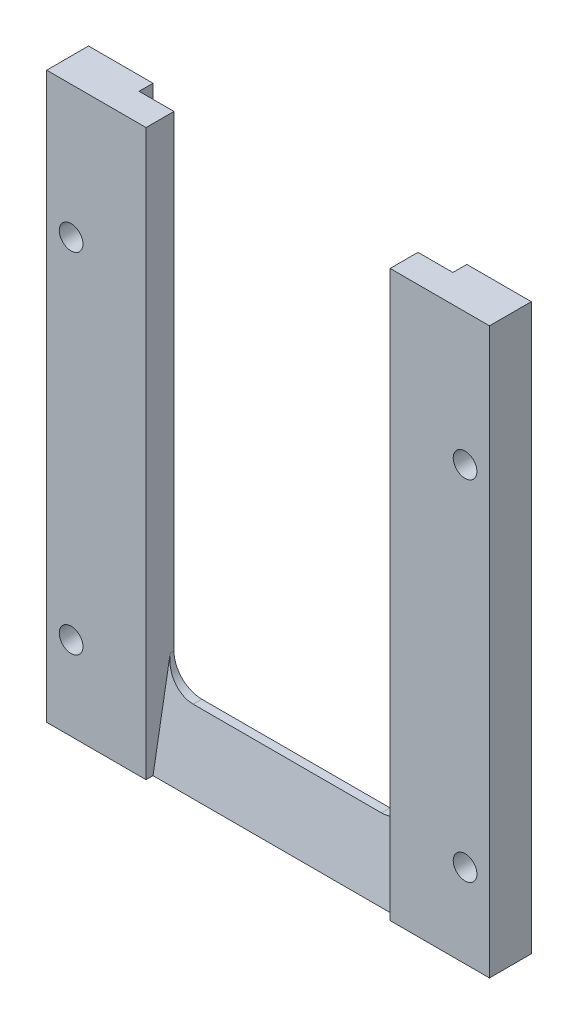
ISO-10303-21;
HEADER;
FILE_DESCRIPTION(('STEP AP214'),'2;1');
FILE_NAME('part.step','',(''),(''),'','','');
FILE_SCHEMA(('AUTOMOTIVE_DESIGN { 1 0 10303 214 1 1 1 1 }'));
ENDSEC;
DATA;
#1=APPLICATION_CONTEXT('core data for automotive mechanical design processes');
#2=APPLICATION_PROTOCOL_DEFINITION('international standard','automotive_design',2000,#1);
#3=PRODUCT_CONTEXT('',#1,'mechanical');
#4=PRODUCT('Part','Part','',(#3));
#5=PRODUCT_RELATED_PRODUCT_CATEGORY('part','',(#4));
#6=PRODUCT_DEFINITION_FORMATION('','',#4);
#7=PRODUCT_DEFINITION_CONTEXT('part definition',#1,'design');
#8=PRODUCT_DEFINITION('design','',#6,#7);
#9=PRODUCT_DEFINITION_SHAPE('','',#8);
#10=(LENGTH_UNIT() NAMED_UNIT(*) SI_UNIT(.MILLI.,.METRE.));
#11=(NAMED_UNIT(*) PLANE_ANGLE_UNIT() SI_UNIT($,.RADIAN.));
#12=(NAMED_UNIT(*) SI_UNIT($,.STERADIAN.) SOLID_ANGLE_UNIT());
#13=UNCERTAINTY_MEASURE_WITH_UNIT(LENGTH_MEASURE(1.E-05),#10,'distance_accuracy_value','');
#14=(GEOMETRIC_REPRESENTATION_CONTEXT(3) GLOBAL_UNCERTAINTY_ASSIGNED_CONTEXT((#13)) GLOBAL_UNIT_ASSIGNED_CONTEXT((#10,
#11,#12)) REPRESENTATION_CONTEXT('',''));
#15=CARTESIAN_POINT('',(0.,0.,0.));
#16=DIRECTION('',(0.,0.,1.));
#17=DIRECTION('',(1.,0.,0.));
#18=AXIS2_PLACEMENT_3D('',#15,#16,#17);
#19=CARTESIAN_POINT('',(31.75,0.,0.));
#20=DIRECTION('',(0.,0.,-1.));
#21=DIRECTION('',(-1.,0.,0.));
#22=AXIS2_PLACEMENT_3D('',#19,#20,#21);
#23=PLANE('',#22);
#24=CARTESIAN_POINT('',(28.25,22.,0.));
#25=DIRECTION('',(0.,0.,-1.));
#26=DIRECTION('',(0.,1.,0.));
#27=AXIS2_PLACEMENT_3D('',#24,#25,#26);
#28=CIRCLE('',#27,1.7);
#29=CARTESIAN_POINT('',(28.25,23.7,0.));
#30=VERTEX_POINT('',#29);
#31=EDGE_CURVE('E204',#30,#30,#28,.T.);
#32=ORIENTED_EDGE('',*,*,#31,.T.);
#33=EDGE_LOOP('',(#32));
#34=FACE_BOUND('',#33,.T.);
#35=CARTESIAN_POINT('',(28.25,-28.,0.));
#36=DIRECTION('',(0.,0.,-1.));
#37=DIRECTION('',(0.,1.,0.));
#38=AXIS2_PLACEMENT_3D('',#35,#36,#37);
#39=CIRCLE('',#38,1.7);
#40=CARTESIAN_POINT('',(28.25,-26.3,0.));
#41=VERTEX_POINT('',#40);
#42=EDGE_CURVE('E195',#41,#41,#39,.T.);
#43=ORIENTED_EDGE('',*,*,#42,.T.);
#44=EDGE_LOOP('',(#43));
#45=FACE_BOUND('',#44,.T.);
#46=DIRECTION('',(0.,-1.,0.));
#47=VECTOR('',#46,1.);
#48=CARTESIAN_POINT('',(17.5,-30.,0.));
#49=LINE('',#48,#47);
#50=CARTESIAN_POINT('',(17.5,41.,0.));
#51=VERTEX_POINT('',#50);
#52=CARTESIAN_POINT('',(17.5,-40.,0.));
#53=VERTEX_POINT('',#52);
#54=EDGE_CURVE('E271',#51,#53,#49,.T.);
#55=ORIENTED_EDGE('',*,*,#54,.T.);
#56=DIRECTION('',(-1.,0.,0.));
#57=VECTOR('',#56,1.);
#58=CARTESIAN_POINT('',(31.75,-40.,0.));
#59=LINE('',#58,#57);
#60=CARTESIAN_POINT('',(31.75,-40.,0.));
#61=VERTEX_POINT('',#60);
#62=EDGE_CURVE('E312',#61,#53,#59,.T.);
#63=ORIENTED_EDGE('',*,*,#62,.F.);
#64=DIRECTION('',(0.,-1.,0.));
#65=VECTOR('',#64,1.);
#66=CARTESIAN_POINT('',(31.75,-40.,0.));
#67=LINE('',#66,#65);
#68=CARTESIAN_POINT('',(31.75,41.,0.));
#69=VERTEX_POINT('',#68);
#70=EDGE_CURVE('E280',#69,#61,#67,.T.);
#71=ORIENTED_EDGE('',*,*,#70,.F.);
#72=DIRECTION('',(-1.,0.,0.));
#73=VECTOR('',#72,1.);
#74=CARTESIAN_POINT('',(31.75,41.,0.));
#75=LINE('',#74,#73);
#76=EDGE_CURVE('E301',#69,#51,#75,.T.);
#77=ORIENTED_EDGE('',*,*,#76,.T.);
#78=EDGE_LOOP('',(#55,#63,#71,#77));
#79=FACE_BOUND('',#78,.T.);
#80=ADVANCED_FACE('F32',(#34,#45,#79),#23,.F.);
#81=CARTESIAN_POINT('',(31.75,41.,0.));
#82=DIRECTION('',(0.,-1.,0.));
#83=DIRECTION('',(0.,0.,-1.));
#84=AXIS2_PLACEMENT_3D('',#81,#82,#83);
#85=PLANE('',#84);
#86=DIRECTION('',(1.,0.,0.));
#87=VECTOR('',#86,1.);
#88=CARTESIAN_POINT('',(22.5,41.,-4.));
#89=LINE('',#88,#87);
#90=CARTESIAN_POINT('',(-22.5,41.,-4.));
#91=VERTEX_POINT('',#90);
#92=CARTESIAN_POINT('',(-17.5,41.,-4.));
#93=VERTEX_POINT('',#92);
#94=EDGE_CURVE('E246',#91,#93,#89,.T.);
#95=ORIENTED_EDGE('',*,*,#94,.F.);
#96=DIRECTION('',(0.,0.,-1.));
#97=VECTOR('',#96,1.);
#98=CARTESIAN_POINT('',(-22.5,41.,-4.));
#99=LINE('',#98,#97);
#100=CARTESIAN_POINT('',(-22.5,41.,-6.));
#101=VERTEX_POINT('',#100);
#102=EDGE_CURVE('E255',#91,#101,#99,.T.);
#103=ORIENTED_EDGE('',*,*,#102,.T.);
#104=DIRECTION('',(-1.,0.,0.));
#105=VECTOR('',#104,1.);
#106=CARTESIAN_POINT('',(31.75,41.,-6.));
#107=LINE('',#106,#105);
#108=CARTESIAN_POINT('',(-31.75,41.,-6.));
#109=VERTEX_POINT('',#108);
#110=EDGE_CURVE('E304',#101,#109,#107,.T.);
#111=ORIENTED_EDGE('',*,*,#110,.T.);
#112=DIRECTION('',(0.,0.,1.));
#113=VECTOR('',#112,1.);
#114=CARTESIAN_POINT('',(-31.75,41.,0.));
#115=LINE('',#114,#113);
#116=CARTESIAN_POINT('',(-31.75,41.,0.));
#117=VERTEX_POINT('',#116);
#118=EDGE_CURVE('E296',#109,#117,#115,.T.);
#119=ORIENTED_EDGE('',*,*,#118,.T.);
#120=CARTESIAN_POINT('',(-17.5,41.,0.));
#121=VERTEX_POINT('',#120);
#122=EDGE_CURVE('E291',#121,#117,#75,.T.);
#123=ORIENTED_EDGE('',*,*,#122,.F.);
#124=DIRECTION('',(0.,0.,-1.));
#125=VECTOR('',#124,1.);
#126=CARTESIAN_POINT('',(-17.5,41.,0.));
#127=LINE('',#126,#125);
#128=EDGE_CURVE('E273',#121,#93,#127,.T.);
#129=ORIENTED_EDGE('',*,*,#128,.T.);
#130=EDGE_LOOP('',(#95,#103,#111,#119,#123,#129));
#131=FACE_BOUND('',#130,.T.);
#132=ADVANCED_FACE('F348',(#131),#85,.F.);
#133=CARTESIAN_POINT('',(31.75,-40.,-6.00000000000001));
#134=DIRECTION('',(0.,1.,0.));
#135=DIRECTION('',(0.,0.,1.));
#136=AXIS2_PLACEMENT_3D('',#133,#134,#135);
#137=PLANE('',#136);
#138=DIRECTION('',(1.,0.,0.));
#139=VECTOR('',#138,1.);
#140=CARTESIAN_POINT('',(-17.5,-40.,-1.));
#141=LINE('',#140,#139);
#142=CARTESIAN_POINT('',(-17.5,-40.,-1.));
#143=VERTEX_POINT('',#142);
#144=CARTESIAN_POINT('',(17.5,-40.,-1.));
#145=VERTEX_POINT('',#144);
#146=EDGE_CURVE('E160',#143,#145,#141,.T.);
#147=ORIENTED_EDGE('',*,*,#146,.F.);
#148=DIRECTION('',(0.,0.,-1.));
#149=VECTOR('',#148,1.);
#150=CARTESIAN_POINT('',(-17.5,-40.,-1.));
#151=LINE('',#150,#149);
#152=CARTESIAN_POINT('',(-17.5,-40.,0.));
#153=VERTEX_POINT('',#152);
#154=EDGE_CURVE('E166',#153,#143,#151,.T.);
#155=ORIENTED_EDGE('',*,*,#154,.F.);
#156=CARTESIAN_POINT('',(-31.75,-40.,0.));
#157=VERTEX_POINT('',#156);
#158=EDGE_CURVE('E311',#153,#157,#59,.T.);
#159=ORIENTED_EDGE('',*,*,#158,.T.);
#160=DIRECTION('',(0.,0.,-1.));
#161=VECTOR('',#160,1.);
#162=CARTESIAN_POINT('',(-31.75,-40.,-6.00000000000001));
#163=LINE('',#162,#161);
#164=CARTESIAN_POINT('',(-31.75,-40.,-6.00000000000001));
#165=VERTEX_POINT('',#164);
#166=EDGE_CURVE('E277',#157,#165,#163,.T.);
#167=ORIENTED_EDGE('',*,*,#166,.T.);
#168=DIRECTION('',(-1.,0.,0.));
#169=VECTOR('',#168,1.);
#170=CARTESIAN_POINT('',(31.75,-40.,-6.00000000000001));
#171=LINE('',#170,#169);
#172=CARTESIAN_POINT('',(31.75,-40.,-6.00000000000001));
#173=VERTEX_POINT('',#172);
#174=EDGE_CURVE('E308',#173,#165,#171,.T.);
#175=ORIENTED_EDGE('',*,*,#174,.F.);
#176=DIRECTION('',(0.,0.,-1.));
#177=VECTOR('',#176,1.);
#178=CARTESIAN_POINT('',(31.75,-40.,-6.00000000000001));
#179=LINE('',#178,#177);
#180=EDGE_CURVE('E283',#61,#173,#179,.T.);
#181=ORIENTED_EDGE('',*,*,#180,.F.);
#182=ORIENTED_EDGE('',*,*,#62,.T.);
#183=DIRECTION('',(0.,0.,-1.));
#184=VECTOR('',#183,1.);
#185=CARTESIAN_POINT('',(17.5,-40.,-1.));
#186=LINE('',#185,#184);
#187=EDGE_CURVE('E180',#53,#145,#186,.T.);
#188=ORIENTED_EDGE('',*,*,#187,.T.);
#189=EDGE_LOOP('',(#147,#155,#159,#167,#175,#181,#182,#188));
#190=FACE_BOUND('',#189,.T.);
#191=ADVANCED_FACE('F177',(#190),#137,.F.);
#192=CARTESIAN_POINT('',(31.75,41.,-6.));
#193=DIRECTION('',(0.,0.,1.));
#194=DIRECTION('',(0.,-1.,0.));
#195=AXIS2_PLACEMENT_3D('',#192,#193,#194);
#196=PLANE('',#195);
#197=CARTESIAN_POINT('',(28.25,-28.,-6.00000000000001));
#198=DIRECTION('',(0.,0.,-1.));
#199=DIRECTION('',(0.,1.,0.));
#200=AXIS2_PLACEMENT_3D('',#197,#198,#199);
#201=CIRCLE('',#200,3.15);
#202=CARTESIAN_POINT('',(28.25,-24.85,-6.00000000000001));
#203=VERTEX_POINT('',#202);
#204=EDGE_CURVE('E189',#203,#203,#201,.T.);
#205=ORIENTED_EDGE('',*,*,#204,.F.);
#206=EDGE_LOOP('',(#205));
#207=FACE_BOUND('',#206,.T.);
#208=CARTESIAN_POINT('',(28.25,22.,-6.));
#209=DIRECTION('',(0.,0.,-1.));
#210=DIRECTION('',(0.,1.,0.));
#211=AXIS2_PLACEMENT_3D('',#208,#209,#210);
#212=CIRCLE('',#211,3.15);
#213=CARTESIAN_POINT('',(28.25,25.15,-6.));
#214=VERTEX_POINT('',#213);
#215=EDGE_CURVE('E198',#214,#214,#212,.T.);
#216=ORIENTED_EDGE('',*,*,#215,.F.);
#217=EDGE_LOOP('',(#216));
#218=FACE_BOUND('',#217,.T.);
#219=CARTESIAN_POINT('',(-28.25,22.,-6.));
#220=DIRECTION('',(0.,0.,-1.));
#221=DIRECTION('',(0.,1.,0.));
#222=AXIS2_PLACEMENT_3D('',#219,#220,#221);
#223=CIRCLE('',#222,3.15);
#224=CARTESIAN_POINT('',(-28.25,25.15,-6.));
#225=VERTEX_POINT('',#224);
#226=EDGE_CURVE('E207',#225,#225,#223,.T.);
#227=ORIENTED_EDGE('',*,*,#226,.F.);
#228=EDGE_LOOP('',(#227));
#229=FACE_BOUND('',#228,.T.);
#230=CARTESIAN_POINT('',(-28.25,-28.,-6.00000000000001));
#231=DIRECTION('',(0.,0.,-1.));
#232=DIRECTION('',(0.,1.,0.));
#233=AXIS2_PLACEMENT_3D('',#230,#231,#232);
#234=CIRCLE('',#233,3.15);
#235=CARTESIAN_POINT('',(-28.25,-24.85,-6.00000000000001));
#236=VERTEX_POINT('',#235);
#237=EDGE_CURVE('E216',#236,#236,#234,.T.);
#238=ORIENTED_EDGE('',*,*,#237,.F.);
#239=EDGE_LOOP('',(#238));
#240=FACE_BOUND('',#239,.T.);
#241=DIRECTION('',(0.,1.,0.));
#242=VECTOR('',#241,1.);
#243=CARTESIAN_POINT('',(-22.5,-34.5,-6.00000000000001));
#244=LINE('',#243,#242);
#245=CARTESIAN_POINT('',(-22.5,-33.,-6.00000000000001));
#246=VERTEX_POINT('',#245);
#247=EDGE_CURVE('E241',#246,#101,#244,.T.);
#248=ORIENTED_EDGE('',*,*,#247,.F.);
#249=CARTESIAN_POINT('',(-22.5,-34.5,-6.00000000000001));
#250=DIRECTION('',(0.,0.,-1.));
#251=DIRECTION('',(0.,1.,0.));
#252=AXIS2_PLACEMENT_3D('',#249,#250,#251);
#253=CIRCLE('',#252,1.5);
#254=CARTESIAN_POINT('',(-21.,-34.5,-6.00000000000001));
#255=VERTEX_POINT('',#254);
#256=EDGE_CURVE('E225',#255,#246,#253,.T.);
#257=ORIENTED_EDGE('',*,*,#256,.F.);
#258=DIRECTION('',(-1.,0.,0.));
#259=VECTOR('',#258,1.);
#260=CARTESIAN_POINT('',(22.5,-34.5,-6.00000000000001));
#261=LINE('',#260,#259);
#262=CARTESIAN_POINT('',(21.,-34.5,-6.00000000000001));
#263=VERTEX_POINT('',#262);
#264=EDGE_CURVE('E245',#263,#255,#261,.T.);
#265=ORIENTED_EDGE('',*,*,#264,.F.);
#266=CARTESIAN_POINT('',(22.5,-34.5,-6.00000000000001));
#267=DIRECTION('',(0.,0.,-1.));
#268=DIRECTION('',(0.,1.,0.));
#269=AXIS2_PLACEMENT_3D('',#266,#267,#268);
#270=CIRCLE('',#269,1.5);
#271=CARTESIAN_POINT('',(22.5,-33.,-6.00000000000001));
#272=VERTEX_POINT('',#271);
#273=EDGE_CURVE('E233',#272,#263,#270,.T.);
#274=ORIENTED_EDGE('',*,*,#273,.F.);
#275=DIRECTION('',(0.,-1.,0.));
#276=VECTOR('',#275,1.);
#277=CARTESIAN_POINT('',(22.5,-34.5,-6.00000000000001));
#278=LINE('',#277,#276);
#279=CARTESIAN_POINT('',(22.5,41.,-6.));
#280=VERTEX_POINT('',#279);
#281=EDGE_CURVE('E257',#280,#272,#278,.T.);
#282=ORIENTED_EDGE('',*,*,#281,.F.);
#283=CARTESIAN_POINT('',(31.75,41.,-6.));
#284=VERTEX_POINT('',#283);
#285=EDGE_CURVE('E305',#284,#280,#107,.T.);
#286=ORIENTED_EDGE('',*,*,#285,.F.);
#287=DIRECTION('',(0.,1.,0.));
#288=VECTOR('',#287,1.);
#289=CARTESIAN_POINT('',(31.75,41.,-6.));
#290=LINE('',#289,#288);
#291=EDGE_CURVE('E286',#173,#284,#290,.T.);
#292=ORIENTED_EDGE('',*,*,#291,.F.);
#293=ORIENTED_EDGE('',*,*,#174,.T.);
#294=DIRECTION('',(0.,1.,0.));
#295=VECTOR('',#294,1.);
#296=CARTESIAN_POINT('',(-31.75,41.,-6.));
#297=LINE('',#296,#295);
#298=EDGE_CURVE('E293',#165,#109,#297,.T.);
#299=ORIENTED_EDGE('',*,*,#298,.T.);
#300=ORIENTED_EDGE('',*,*,#110,.F.);
#301=EDGE_LOOP('',(#248,#257,#265,#274,#282,#286,#292,#293,#299,#300));
#302=FACE_BOUND('',#301,.T.);
#303=ADVANCED_FACE('F360',(#207,#218,#229,#240,#302),#196,.F.);
#304=ORIENTED_EDGE('',*,*,#285,.T.);
#305=DIRECTION('',(0.,0.,-1.));
#306=VECTOR('',#305,1.);
#307=CARTESIAN_POINT('',(22.5,41.,-4.));
#308=LINE('',#307,#306);
#309=CARTESIAN_POINT('',(22.5,41.,-4.));
#310=VERTEX_POINT('',#309);
#311=EDGE_CURVE('E262',#310,#280,#308,.T.);
#312=ORIENTED_EDGE('',*,*,#311,.F.);
#313=CARTESIAN_POINT('',(17.5,41.,-4.));
#314=VERTEX_POINT('',#313);
#315=EDGE_CURVE('E244',#314,#310,#89,.T.);
#316=ORIENTED_EDGE('',*,*,#315,.F.);
#317=DIRECTION('',(0.,0.,-1.));
#318=VECTOR('',#317,1.);
#319=CARTESIAN_POINT('',(17.5,41.,0.));
#320=LINE('',#319,#318);
#321=EDGE_CURVE('E274',#51,#314,#320,.T.);
#322=ORIENTED_EDGE('',*,*,#321,.F.);
#323=ORIENTED_EDGE('',*,*,#76,.F.);
#324=DIRECTION('',(0.,0.,1.));
#325=VECTOR('',#324,1.);
#326=CARTESIAN_POINT('',(31.75,41.,0.));
#327=LINE('',#326,#325);
#328=EDGE_CURVE('E288',#284,#69,#327,.T.);
#329=ORIENTED_EDGE('',*,*,#328,.F.);
#330=EDGE_LOOP('',(#304,#312,#316,#322,#323,#329));
#331=FACE_BOUND('',#330,.T.);
#332=ADVANCED_FACE('F381',(#331),#85,.F.);
#333=CARTESIAN_POINT('',(-28.25,22.,0.));
#334=DIRECTION('',(0.,0.,-1.));
#335=DIRECTION('',(0.,1.,0.));
#336=AXIS2_PLACEMENT_3D('',#333,#334,#335);
#337=CIRCLE('',#336,1.7);
#338=CARTESIAN_POINT('',(-28.25,23.7,0.));
#339=VERTEX_POINT('',#338);
#340=EDGE_CURVE('E213',#339,#339,#337,.T.);
#341=ORIENTED_EDGE('',*,*,#340,.T.);
#342=EDGE_LOOP('',(#341));
#343=FACE_BOUND('',#342,.T.);
#344=CARTESIAN_POINT('',(-28.25,-28.,0.));
#345=DIRECTION('',(0.,0.,-1.));
#346=DIRECTION('',(0.,1.,0.));
#347=AXIS2_PLACEMENT_3D('',#344,#345,#346);
#348=CIRCLE('',#347,1.7);
#349=CARTESIAN_POINT('',(-28.25,-26.3,0.));
#350=VERTEX_POINT('',#349);
#351=EDGE_CURVE('E222',#350,#350,#348,.T.);
#352=ORIENTED_EDGE('',*,*,#351,.T.);
#353=EDGE_LOOP('',(#352));
#354=FACE_BOUND('',#353,.T.);
#355=ORIENTED_EDGE('',*,*,#158,.F.);
#356=DIRECTION('',(0.,1.,0.));
#357=VECTOR('',#356,1.);
#358=CARTESIAN_POINT('',(-17.5,-30.,0.));
#359=LINE('',#358,#357);
#360=EDGE_CURVE('E171',#153,#121,#359,.T.);
#361=ORIENTED_EDGE('',*,*,#360,.T.);
#362=ORIENTED_EDGE('',*,*,#122,.T.);
#363=DIRECTION('',(0.,-1.,0.));
#364=VECTOR('',#363,1.);
#365=CARTESIAN_POINT('',(-31.75,0.,0.));
#366=LINE('',#365,#364);
#367=EDGE_CURVE('E284',#117,#157,#366,.T.);
#368=ORIENTED_EDGE('',*,*,#367,.T.);
#369=EDGE_LOOP('',(#355,#361,#362,#368));
#370=FACE_BOUND('',#369,.T.);
#371=ADVANCED_FACE('F352',(#343,#354,#370),#23,.F.);
#372=CARTESIAN_POINT('',(31.75,0.,0.));
#373=DIRECTION('',(-1.,0.,0.));
#374=DIRECTION('',(0.,0.,1.));
#375=AXIS2_PLACEMENT_3D('',#372,#373,#374);
#376=PLANE('',#375);
#377=ORIENTED_EDGE('',*,*,#70,.T.);
#378=ORIENTED_EDGE('',*,*,#180,.T.);
#379=ORIENTED_EDGE('',*,*,#291,.T.);
#380=ORIENTED_EDGE('',*,*,#328,.T.);
#381=EDGE_LOOP('',(#377,#378,#379,#380));
#382=FACE_BOUND('',#381,.T.);
#383=ADVANCED_FACE('F365',(#382),#376,.F.);
#384=CARTESIAN_POINT('',(-31.75,0.,0.));
#385=DIRECTION('',(-1.,0.,0.));
#386=DIRECTION('',(0.,0.,1.));
#387=AXIS2_PLACEMENT_3D('',#384,#385,#386);
#388=PLANE('',#387);
#389=ORIENTED_EDGE('',*,*,#166,.F.);
#390=ORIENTED_EDGE('',*,*,#367,.F.);
#391=ORIENTED_EDGE('',*,*,#118,.F.);
#392=ORIENTED_EDGE('',*,*,#298,.F.);
#393=EDGE_LOOP('',(#389,#390,#391,#392));
#394=FACE_BOUND('',#393,.T.);
#395=ADVANCED_FACE('F363',(#394),#388,.T.);
#396=CARTESIAN_POINT('',(-17.5,-30.,0.));
#397=DIRECTION('',(-1.,0.,0.));
#398=DIRECTION('',(0.,0.,1.));
#399=AXIS2_PLACEMENT_3D('',#396,#397,#398);
#400=PLANE('',#399);
#401=ORIENTED_EDGE('',*,*,#128,.F.);
#402=ORIENTED_EDGE('',*,*,#360,.F.);
#403=ORIENTED_EDGE('',*,*,#154,.T.);
#404=DIRECTION('',(0.,0.984807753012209,-0.173648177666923));
#405=VECTOR('',#404,1.);
#406=CARTESIAN_POINT('',(-17.5,-25.,-3.64490471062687));
#407=LINE('',#406,#405);
#408=CARTESIAN_POINT('',(-17.5,-26.,-3.46857772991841));
#409=VERTEX_POINT('',#408);
#410=EDGE_CURVE('E156',#143,#409,#407,.T.);
#411=ORIENTED_EDGE('',*,*,#410,.T.);
#412=DIRECTION('',(0.,0.,-1.));
#413=VECTOR('',#412,1.);
#414=CARTESIAN_POINT('',(-17.5,-26.,-4.00000000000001));
#415=LINE('',#414,#413);
#416=CARTESIAN_POINT('',(-17.5,-26.,-4.00000000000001));
#417=VERTEX_POINT('',#416);
#418=EDGE_CURVE('E322',#409,#417,#415,.T.);
#419=ORIENTED_EDGE('',*,*,#418,.T.);
#420=DIRECTION('',(0.,1.,0.));
#421=VECTOR('',#420,1.);
#422=CARTESIAN_POINT('',(-17.5,-30.,-4.00000000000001));
#423=LINE('',#422,#421);
#424=EDGE_CURVE('E268',#417,#93,#423,.T.);
#425=ORIENTED_EDGE('',*,*,#424,.T.);
#426=EDGE_LOOP('',(#401,#402,#403,#411,#419,#425));
#427=FACE_BOUND('',#426,.T.);
#428=ADVANCED_FACE('F170',(#427),#400,.F.);
#429=CARTESIAN_POINT('',(17.5,-30.,0.));
#430=DIRECTION('',(0.,-1.,0.));
#431=DIRECTION('',(0.,0.,-1.));
#432=AXIS2_PLACEMENT_3D('',#429,#430,#431);
#433=PLANE('',#432);
#434=DIRECTION('',(0.,0.,-1.));
#435=VECTOR('',#434,1.);
#436=CARTESIAN_POINT('',(-13.5,-30.,0.));
#437=LINE('',#436,#435);
#438=CARTESIAN_POINT('',(-13.5,-30.,-4.00000000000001));
#439=VERTEX_POINT('',#438);
#440=CARTESIAN_POINT('',(-13.5,-30.,-2.76326980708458));
#441=VERTEX_POINT('',#440);
#442=EDGE_CURVE('E326',#439,#441,#437,.F.);
#443=ORIENTED_EDGE('',*,*,#442,.T.);
#444=DIRECTION('',(1.,0.,0.));
#445=VECTOR('',#444,1.);
#446=CARTESIAN_POINT('',(17.5,-30.,-2.76326980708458));
#447=LINE('',#446,#445);
#448=CARTESIAN_POINT('',(13.5,-30.,-2.76326980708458));
#449=VERTEX_POINT('',#448);
#450=EDGE_CURVE('E181',#441,#449,#447,.T.);
#451=ORIENTED_EDGE('',*,*,#450,.T.);
#452=DIRECTION('',(0.,0.,-1.));
#453=VECTOR('',#452,1.);
#454=CARTESIAN_POINT('',(13.5,-30.,-4.));
#455=LINE('',#454,#453);
#456=CARTESIAN_POINT('',(13.5,-30.,-4.00000000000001));
#457=VERTEX_POINT('',#456);
#458=EDGE_CURVE('E324',#449,#457,#455,.T.);
#459=ORIENTED_EDGE('',*,*,#458,.T.);
#460=DIRECTION('',(-1.,0.,0.));
#461=VECTOR('',#460,1.);
#462=CARTESIAN_POINT('',(17.5,-30.,-4.00000000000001));
#463=LINE('',#462,#461);
#464=EDGE_CURVE('E264',#457,#439,#463,.T.);
#465=ORIENTED_EDGE('',*,*,#464,.T.);
#466=EDGE_LOOP('',(#443,#451,#459,#465));
#467=FACE_BOUND('',#466,.T.);
#468=ADVANCED_FACE('F338',(#467),#433,.F.);
#469=CARTESIAN_POINT('',(17.5,-30.,0.));
#470=DIRECTION('',(1.,0.,0.));
#471=DIRECTION('',(0.,0.,-1.));
#472=AXIS2_PLACEMENT_3D('',#469,#470,#471);
#473=PLANE('',#472);
#474=ORIENTED_EDGE('',*,*,#187,.F.);
#475=ORIENTED_EDGE('',*,*,#54,.F.);
#476=ORIENTED_EDGE('',*,*,#321,.T.);
#477=DIRECTION('',(0.,-1.,0.));
#478=VECTOR('',#477,1.);
#479=CARTESIAN_POINT('',(17.5,-30.,-4.00000000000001));
#480=LINE('',#479,#478);
#481=CARTESIAN_POINT('',(17.5,-26.,-4.00000000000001));
#482=VERTEX_POINT('',#481);
#483=EDGE_CURVE('E314',#314,#482,#480,.T.);
#484=ORIENTED_EDGE('',*,*,#483,.T.);
#485=DIRECTION('',(0.,0.,-1.));
#486=VECTOR('',#485,1.);
#487=CARTESIAN_POINT('',(17.5,-26.,0.));
#488=LINE('',#487,#486);
#489=CARTESIAN_POINT('',(17.5,-26.,-3.46857772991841));
#490=VERTEX_POINT('',#489);
#491=EDGE_CURVE('E329',#482,#490,#488,.F.);
#492=ORIENTED_EDGE('',*,*,#491,.T.);
#493=DIRECTION('',(0.,0.984807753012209,-0.173648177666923));
#494=VECTOR('',#493,1.);
#495=CARTESIAN_POINT('',(17.5,-25.,-3.64490471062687));
#496=LINE('',#495,#494);
#497=EDGE_CURVE('E174',#145,#490,#496,.T.);
#498=ORIENTED_EDGE('',*,*,#497,.F.);
#499=EDGE_LOOP('',(#474,#475,#476,#484,#492,#498));
#500=FACE_BOUND('',#499,.T.);
#501=ADVANCED_FACE('F334',(#500),#473,.F.);
#502=CARTESIAN_POINT('',(0.,0.,-4.00000000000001));
#503=DIRECTION('',(0.,0.,1.));
#504=DIRECTION('',(0.,-1.,0.));
#505=AXIS2_PLACEMENT_3D('',#502,#503,#504);
#506=PLANE('',#505);
#507=DIRECTION('',(-1.,0.,0.));
#508=VECTOR('',#507,1.);
#509=CARTESIAN_POINT('',(22.5,-34.5,-4.00000000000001));
#510=LINE('',#509,#508);
#511=CARTESIAN_POINT('',(21.,-34.5,-4.00000000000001));
#512=VERTEX_POINT('',#511);
#513=CARTESIAN_POINT('',(-21.,-34.5,-4.00000000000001));
#514=VERTEX_POINT('',#513);
#515=EDGE_CURVE('E252',#512,#514,#510,.T.);
#516=ORIENTED_EDGE('',*,*,#515,.T.);
#517=CARTESIAN_POINT('',(-22.5,-34.5,-4.00000000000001));
#518=DIRECTION('',(0.,0.,-1.));
#519=DIRECTION('',(0.,1.,0.));
#520=AXIS2_PLACEMENT_3D('',#517,#518,#519);
#521=CIRCLE('',#520,1.5);
#522=CARTESIAN_POINT('',(-22.5,-33.,-4.00000000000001));
#523=VERTEX_POINT('',#522);
#524=EDGE_CURVE('E226',#514,#523,#521,.T.);
#525=ORIENTED_EDGE('',*,*,#524,.T.);
#526=DIRECTION('',(0.,1.,0.));
#527=VECTOR('',#526,1.);
#528=CARTESIAN_POINT('',(-22.5,-34.5,-4.00000000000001));
#529=LINE('',#528,#527);
#530=EDGE_CURVE('E242',#523,#91,#529,.T.);
#531=ORIENTED_EDGE('',*,*,#530,.T.);
#532=ORIENTED_EDGE('',*,*,#94,.T.);
#533=ORIENTED_EDGE('',*,*,#424,.F.);
#534=CARTESIAN_POINT('',(-13.5,-26.,-4.00000000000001));
#535=DIRECTION('',(0.,0.,1.));
#536=DIRECTION('',(0.,-1.,0.));
#537=AXIS2_PLACEMENT_3D('',#534,#535,#536);
#538=CIRCLE('',#537,4.);
#539=EDGE_CURVE('E52',#417,#439,#538,.T.);
#540=ORIENTED_EDGE('',*,*,#539,.T.);
#541=ORIENTED_EDGE('',*,*,#464,.F.);
#542=CARTESIAN_POINT('',(13.5,-26.,-4.00000000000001));
#543=DIRECTION('',(0.,0.,1.));
#544=DIRECTION('',(0.,-1.,0.));
#545=AXIS2_PLACEMENT_3D('',#542,#543,#544);
#546=CIRCLE('',#545,4.);
#547=EDGE_CURVE('E40',#457,#482,#546,.T.);
#548=ORIENTED_EDGE('',*,*,#547,.T.);
#549=ORIENTED_EDGE('',*,*,#483,.F.);
#550=ORIENTED_EDGE('',*,*,#315,.T.);
#551=DIRECTION('',(0.,-1.,0.));
#552=VECTOR('',#551,1.);
#553=CARTESIAN_POINT('',(22.5,-34.5,-4.00000000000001));
#554=LINE('',#553,#552);
#555=CARTESIAN_POINT('',(22.5,-33.,-4.00000000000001));
#556=VERTEX_POINT('',#555);
#557=EDGE_CURVE('E249',#310,#556,#554,.T.);
#558=ORIENTED_EDGE('',*,*,#557,.T.);
#559=CARTESIAN_POINT('',(22.5,-34.5,-4.00000000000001));
#560=DIRECTION('',(0.,0.,-1.));
#561=DIRECTION('',(0.,1.,0.));
#562=AXIS2_PLACEMENT_3D('',#559,#560,#561);
#563=CIRCLE('',#562,1.5);
#564=EDGE_CURVE('E234',#556,#512,#563,.T.);
#565=ORIENTED_EDGE('',*,*,#564,.T.);
#566=EDGE_LOOP('',(#516,#525,#531,#532,#533,#540,#541,#548,#549,#550,#558,#565));
#567=FACE_BOUND('',#566,.T.);
#568=ADVANCED_FACE('F344',(#567),#506,.F.);
#569=CARTESIAN_POINT('',(-22.5,-34.5,-4.00000000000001));
#570=DIRECTION('',(-1.,0.,0.));
#571=DIRECTION('',(0.,0.,1.));
#572=AXIS2_PLACEMENT_3D('',#569,#570,#571);
#573=PLANE('',#572);
#574=ORIENTED_EDGE('',*,*,#530,.F.);
#575=DIRECTION('',(0.,0.,-1.));
#576=VECTOR('',#575,1.);
#577=CARTESIAN_POINT('',(-22.5,-33.,-4.00000000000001));
#578=LINE('',#577,#576);
#579=EDGE_CURVE('E229',#523,#246,#578,.T.);
#580=ORIENTED_EDGE('',*,*,#579,.T.);
#581=ORIENTED_EDGE('',*,*,#247,.T.);
#582=ORIENTED_EDGE('',*,*,#102,.F.);
#583=EDGE_LOOP('',(#574,#580,#581,#582));
#584=FACE_BOUND('',#583,.T.);
#585=ADVANCED_FACE('F459',(#584),#573,.F.);
#586=CARTESIAN_POINT('',(22.5,-34.5,-4.00000000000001));
#587=DIRECTION('',(0.,-1.,0.));
#588=DIRECTION('',(0.,0.,-1.));
#589=AXIS2_PLACEMENT_3D('',#586,#587,#588);
#590=PLANE('',#589);
#591=ORIENTED_EDGE('',*,*,#264,.T.);
#592=DIRECTION('',(0.,0.,-1.));
#593=VECTOR('',#592,1.);
#594=CARTESIAN_POINT('',(-21.,-34.5,-4.00000000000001));
#595=LINE('',#594,#593);
#596=EDGE_CURVE('E319',#255,#514,#595,.F.);
#597=ORIENTED_EDGE('',*,*,#596,.T.);
#598=ORIENTED_EDGE('',*,*,#515,.F.);
#599=DIRECTION('',(0.,0.,-1.));
#600=VECTOR('',#599,1.);
#601=CARTESIAN_POINT('',(21.,-34.5,-4.00000000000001));
#602=LINE('',#601,#600);
#603=EDGE_CURVE('E237',#512,#263,#602,.T.);
#604=ORIENTED_EDGE('',*,*,#603,.T.);
#605=EDGE_LOOP('',(#591,#597,#598,#604));
#606=FACE_BOUND('',#605,.T.);
#607=ADVANCED_FACE('F460',(#606),#590,.F.);
#608=CARTESIAN_POINT('',(22.5,-34.5,-4.00000000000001));
#609=DIRECTION('',(1.,0.,0.));
#610=DIRECTION('',(0.,0.,-1.));
#611=AXIS2_PLACEMENT_3D('',#608,#609,#610);
#612=PLANE('',#611);
#613=ORIENTED_EDGE('',*,*,#281,.T.);
#614=DIRECTION('',(0.,0.,-1.));
#615=VECTOR('',#614,1.);
#616=CARTESIAN_POINT('',(22.5,-33.,-4.00000000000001));
#617=LINE('',#616,#615);
#618=EDGE_CURVE('E316',#272,#556,#617,.F.);
#619=ORIENTED_EDGE('',*,*,#618,.T.);
#620=ORIENTED_EDGE('',*,*,#557,.F.);
#621=ORIENTED_EDGE('',*,*,#311,.T.);
#622=EDGE_LOOP('',(#613,#619,#620,#621));
#623=FACE_BOUND('',#622,.T.);
#624=ADVANCED_FACE('F455',(#623),#612,.F.);
#625=CARTESIAN_POINT('',(22.5,-34.5,-4.00000000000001));
#626=DIRECTION('',(0.,0.,-1.));
#627=DIRECTION('',(0.,1.,0.));
#628=AXIS2_PLACEMENT_3D('',#625,#626,#627);
#629=CYLINDRICAL_SURFACE('',#628,1.5);
#630=ORIENTED_EDGE('',*,*,#564,.F.);
#631=ORIENTED_EDGE('',*,*,#618,.F.);
#632=ORIENTED_EDGE('',*,*,#273,.T.);
#633=ORIENTED_EDGE('',*,*,#603,.F.);
#634=EDGE_LOOP('',(#630,#631,#632,#633));
#635=FACE_BOUND('',#634,.T.);
#636=ADVANCED_FACE('F451',(#635),#629,.F.);
#637=CARTESIAN_POINT('',(-22.5,-34.5,-4.00000000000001));
#638=DIRECTION('',(0.,0.,-1.));
#639=DIRECTION('',(0.,1.,0.));
#640=AXIS2_PLACEMENT_3D('',#637,#638,#639);
#641=CYLINDRICAL_SURFACE('',#640,1.5);
#642=ORIENTED_EDGE('',*,*,#524,.F.);
#643=ORIENTED_EDGE('',*,*,#596,.F.);
#644=ORIENTED_EDGE('',*,*,#256,.T.);
#645=ORIENTED_EDGE('',*,*,#579,.F.);
#646=EDGE_LOOP('',(#642,#643,#644,#645));
#647=FACE_BOUND('',#646,.T.);
#648=ADVANCED_FACE('F397',(#647),#641,.F.);
#649=CARTESIAN_POINT('',(-28.25,-28.,-6.00000000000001));
#650=DIRECTION('',(0.,0.,-1.));
#651=DIRECTION('',(0.,1.,0.));
#652=AXIS2_PLACEMENT_3D('',#649,#650,#651);
#653=CYLINDRICAL_SURFACE('',#652,1.69999999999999);
#654=ORIENTED_EDGE('',*,*,#351,.F.);
#655=EDGE_LOOP('',(#654));
#656=FACE_BOUND('',#655,.T.);
#657=CARTESIAN_POINT('',(-28.25,-28.,-4.55));
#658=DIRECTION('',(0.,0.,-1.));
#659=DIRECTION('',(0.,1.,0.));
#660=AXIS2_PLACEMENT_3D('',#657,#658,#659);
#661=CIRCLE('',#660,1.69999999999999);
#662=CARTESIAN_POINT('',(-28.25,-26.3,-4.55));
#663=VERTEX_POINT('',#662);
#664=EDGE_CURVE('E219',#663,#663,#661,.T.);
#665=ORIENTED_EDGE('',*,*,#664,.T.);
#666=EDGE_LOOP('',(#665));
#667=FACE_BOUND('',#666,.T.);
#668=ADVANCED_FACE('F393',(#656,#667),#653,.F.);
#669=CARTESIAN_POINT('',(-28.25,-28.,-6.00000000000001));
#670=DIRECTION('',(0.,0.,-1.));
#671=DIRECTION('',(0.,1.,0.));
#672=AXIS2_PLACEMENT_3D('',#669,#670,#671);
#673=CONICAL_SURFACE('',#672,3.15,0.785398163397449);
#674=ORIENTED_EDGE('',*,*,#664,.F.);
#675=EDGE_LOOP('',(#674));
#676=FACE_BOUND('',#675,.T.);
#677=ORIENTED_EDGE('',*,*,#237,.T.);
#678=EDGE_LOOP('',(#677));
#679=FACE_BOUND('',#678,.T.);
#680=ADVANCED_FACE('F396',(#676,#679),#673,.F.);
#681=CARTESIAN_POINT('',(-28.25,22.,-6.));
#682=DIRECTION('',(0.,0.,-1.));
#683=DIRECTION('',(0.,1.,0.));
#684=AXIS2_PLACEMENT_3D('',#681,#682,#683);
#685=CYLINDRICAL_SURFACE('',#684,1.69999999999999);
#686=ORIENTED_EDGE('',*,*,#340,.F.);
#687=EDGE_LOOP('',(#686));
#688=FACE_BOUND('',#687,.T.);
#689=CARTESIAN_POINT('',(-28.25,22.,-4.55));
#690=DIRECTION('',(0.,0.,-1.));
#691=DIRECTION('',(0.,1.,0.));
#692=AXIS2_PLACEMENT_3D('',#689,#690,#691);
#693=CIRCLE('',#692,1.69999999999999);
#694=CARTESIAN_POINT('',(-28.25,23.7,-4.55));
#695=VERTEX_POINT('',#694);
#696=EDGE_CURVE('E210',#695,#695,#693,.T.);
#697=ORIENTED_EDGE('',*,*,#696,.T.);
#698=EDGE_LOOP('',(#697));
#699=FACE_BOUND('',#698,.T.);
#700=ADVANCED_FACE('F403',(#688,#699),#685,.F.);
#701=CARTESIAN_POINT('',(-28.25,22.,-6.));
#702=DIRECTION('',(0.,0.,-1.));
#703=DIRECTION('',(0.,1.,0.));
#704=AXIS2_PLACEMENT_3D('',#701,#702,#703);
#705=CONICAL_SURFACE('',#704,3.15,0.785398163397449);
#706=ORIENTED_EDGE('',*,*,#696,.F.);
#707=EDGE_LOOP('',(#706));
#708=FACE_BOUND('',#707,.T.);
#709=ORIENTED_EDGE('',*,*,#226,.T.);
#710=EDGE_LOOP('',(#709));
#711=FACE_BOUND('',#710,.T.);
#712=ADVANCED_FACE('F441',(#708,#711),#705,.F.);
#713=CARTESIAN_POINT('',(28.25,22.,-6.));
#714=DIRECTION('',(0.,0.,-1.));
#715=DIRECTION('',(0.,1.,0.));
#716=AXIS2_PLACEMENT_3D('',#713,#714,#715);
#717=CYLINDRICAL_SURFACE('',#716,1.69999999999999);
#718=ORIENTED_EDGE('',*,*,#31,.F.);
#719=EDGE_LOOP('',(#718));
#720=FACE_BOUND('',#719,.T.);
#721=CARTESIAN_POINT('',(28.25,22.,-4.55));
#722=DIRECTION('',(0.,0.,-1.));
#723=DIRECTION('',(0.,1.,0.));
#724=AXIS2_PLACEMENT_3D('',#721,#722,#723);
#725=CIRCLE('',#724,1.69999999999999);
#726=CARTESIAN_POINT('',(28.25,23.7,-4.55));
#727=VERTEX_POINT('',#726);
#728=EDGE_CURVE('E201',#727,#727,#725,.T.);
#729=ORIENTED_EDGE('',*,*,#728,.T.);
#730=EDGE_LOOP('',(#729));
#731=FACE_BOUND('',#730,.T.);
#732=ADVANCED_FACE('F437',(#720,#731),#717,.F.);
#733=CARTESIAN_POINT('',(28.25,22.,-6.));
#734=DIRECTION('',(0.,0.,-1.));
#735=DIRECTION('',(0.,1.,0.));
#736=AXIS2_PLACEMENT_3D('',#733,#734,#735);
#737=CONICAL_SURFACE('',#736,3.15,0.785398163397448);
#738=ORIENTED_EDGE('',*,*,#728,.F.);
#739=EDGE_LOOP('',(#738));
#740=FACE_BOUND('',#739,.T.);
#741=ORIENTED_EDGE('',*,*,#215,.T.);
#742=EDGE_LOOP('',(#741));
#743=FACE_BOUND('',#742,.T.);
#744=ADVANCED_FACE('F428',(#740,#743),#737,.F.);
#745=CARTESIAN_POINT('',(28.25,-28.,-6.00000000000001));
#746=DIRECTION('',(0.,0.,-1.));
#747=DIRECTION('',(0.,1.,0.));
#748=AXIS2_PLACEMENT_3D('',#745,#746,#747);
#749=CYLINDRICAL_SURFACE('',#748,1.69999999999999);
#750=ORIENTED_EDGE('',*,*,#42,.F.);
#751=EDGE_LOOP('',(#750));
#752=FACE_BOUND('',#751,.T.);
#753=CARTESIAN_POINT('',(28.25,-28.,-4.55));
#754=DIRECTION('',(0.,0.,-1.));
#755=DIRECTION('',(0.,1.,0.));
#756=AXIS2_PLACEMENT_3D('',#753,#754,#755);
#757=CIRCLE('',#756,1.69999999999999);
#758=CARTESIAN_POINT('',(28.25,-26.3,-4.55));
#759=VERTEX_POINT('',#758);
#760=EDGE_CURVE('E192',#759,#759,#757,.T.);
#761=ORIENTED_EDGE('',*,*,#760,.T.);
#762=EDGE_LOOP('',(#761));
#763=FACE_BOUND('',#762,.T.);
#764=ADVANCED_FACE('F422',(#752,#763),#749,.F.);
#765=CARTESIAN_POINT('',(28.25,-28.,-6.00000000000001));
#766=DIRECTION('',(0.,0.,-1.));
#767=DIRECTION('',(0.,1.,0.));
#768=AXIS2_PLACEMENT_3D('',#765,#766,#767);
#769=CONICAL_SURFACE('',#768,3.15,0.78539816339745);
#770=ORIENTED_EDGE('',*,*,#760,.F.);
#771=EDGE_LOOP('',(#770));
#772=FACE_BOUND('',#771,.T.);
#773=ORIENTED_EDGE('',*,*,#204,.T.);
#774=EDGE_LOOP('',(#773));
#775=FACE_BOUND('',#774,.T.);
#776=ADVANCED_FACE('F417',(#772,#775),#769,.F.);
#777=CARTESIAN_POINT('',(-13.5,-26.,0.));
#778=DIRECTION('',(0.,0.,1.));
#779=DIRECTION('',(0.,-1.,0.));
#780=AXIS2_PLACEMENT_3D('',#777,#778,#779);
#781=CYLINDRICAL_SURFACE('',#780,4.);
#782=ORIENTED_EDGE('',*,*,#418,.F.);
#783=CARTESIAN_POINT('',(-13.5,-26.,-3.46857772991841));
#784=DIRECTION('',(0.,-0.173648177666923,-0.984807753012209));
#785=DIRECTION('',(0.,-0.984807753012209,0.173648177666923));
#786=AXIS2_PLACEMENT_3D('',#783,#784,#785);
#787=ELLIPSE('',#786,4.06170644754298,4.);
#788=EDGE_CURVE('E163',#409,#441,#787,.F.);
#789=ORIENTED_EDGE('',*,*,#788,.T.);
#790=ORIENTED_EDGE('',*,*,#442,.F.);
#791=ORIENTED_EDGE('',*,*,#539,.F.);
#792=EDGE_LOOP('',(#782,#789,#790,#791));
#793=FACE_BOUND('',#792,.T.);
#794=ADVANCED_FACE('F341',(#793),#781,.F.);
#795=CARTESIAN_POINT('',(13.5,-26.,0.));
#796=DIRECTION('',(0.,0.,1.));
#797=DIRECTION('',(0.,-1.,0.));
#798=AXIS2_PLACEMENT_3D('',#795,#796,#797);
#799=CYLINDRICAL_SURFACE('',#798,4.);
#800=ORIENTED_EDGE('',*,*,#458,.F.);
#801=CARTESIAN_POINT('',(13.5,-26.,-3.46857772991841));
#802=DIRECTION('',(0.,-0.173648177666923,-0.984807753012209));
#803=DIRECTION('',(0.,-0.984807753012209,0.173648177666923));
#804=AXIS2_PLACEMENT_3D('',#801,#802,#803);
#805=ELLIPSE('',#804,4.06170644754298,4.);
#806=EDGE_CURVE('E11',#449,#490,#805,.F.);
#807=ORIENTED_EDGE('',*,*,#806,.T.);
#808=ORIENTED_EDGE('',*,*,#491,.F.);
#809=ORIENTED_EDGE('',*,*,#547,.F.);
#810=EDGE_LOOP('',(#800,#807,#808,#809));
#811=FACE_BOUND('',#810,.T.);
#812=ADVANCED_FACE('F34',(#811),#799,.F.);
#813=CARTESIAN_POINT('',(-17.5,-25.,-3.64490471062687));
#814=DIRECTION('',(0.,-0.173648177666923,-0.984807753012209));
#815=DIRECTION('',(0.,0.984807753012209,-0.173648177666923));
#816=AXIS2_PLACEMENT_3D('',#813,#814,#815);
#817=PLANE('',#816);
#818=ORIENTED_EDGE('',*,*,#410,.F.);
#819=ORIENTED_EDGE('',*,*,#146,.T.);
#820=ORIENTED_EDGE('',*,*,#497,.T.);
#821=ORIENTED_EDGE('',*,*,#806,.F.);
#822=ORIENTED_EDGE('',*,*,#450,.F.);
#823=ORIENTED_EDGE('',*,*,#788,.F.);
#824=EDGE_LOOP('',(#818,#819,#820,#821,#822,#823));
#825=FACE_BOUND('',#824,.T.);
#826=ADVANCED_FACE('F158',(#825),#817,.F.);
#827=CLOSED_SHELL('',(#80,#132,#191,#303,#332,#371,#383,#395,#428,#468,#501,#568,#585,#607,#624,
#636,#648,#668,#680,#700,#712,#732,#744,#764,#776,#794,#812,#826));
#828=MANIFOLD_SOLID_BREP('B2',#827);
#829=ADVANCED_BREP_SHAPE_REPRESENTATION('',(#18,#828),#14);
#830=SHAPE_DEFINITION_REPRESENTATION(#9,#829);
ENDSEC;
END-ISO-10303-21;
